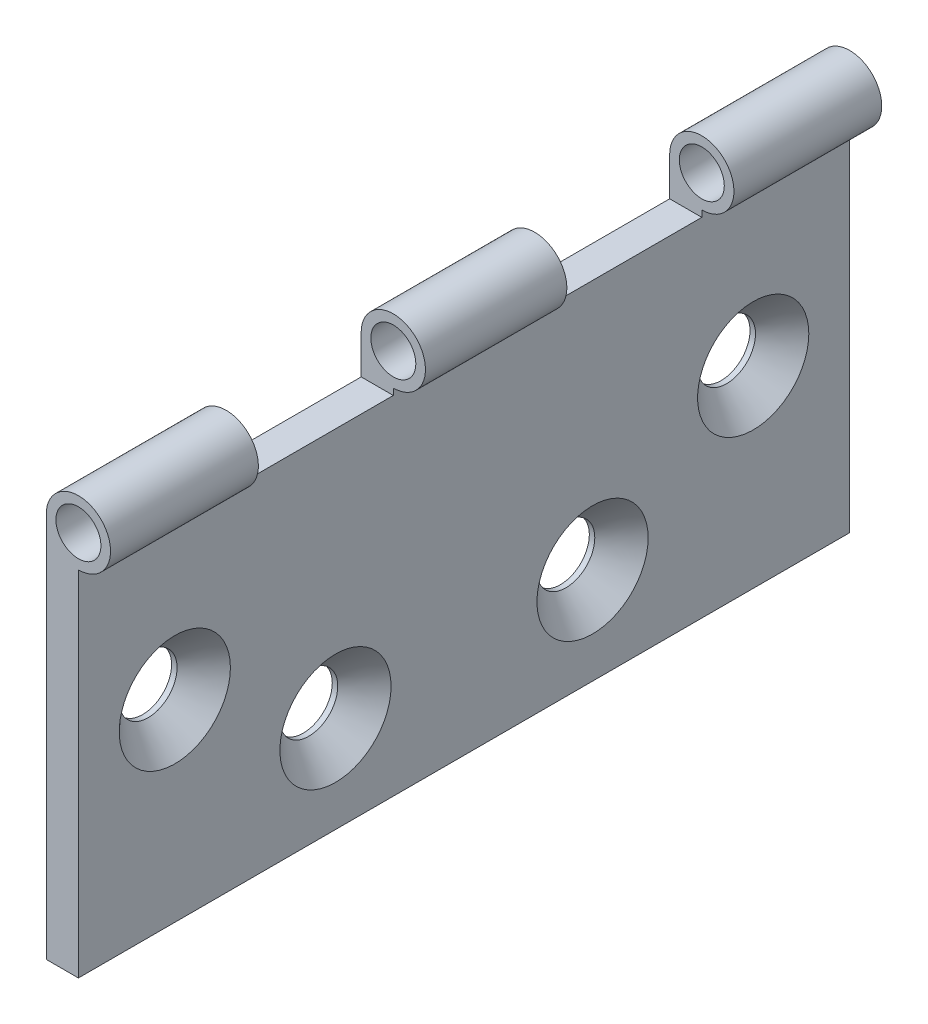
from build123d import *

# Parameters (mm, degrees)
SKETCH1_W                                      = 5
SKETCH1_H                                      = 60
EXTRUDE_THIN1_DEPTH                            = 60
SKETCH2_R                                      = 5
SKETCH3_R                                      = 3.5
CUT_EXTRUDE1_DEPTH                             = 137.839321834
CSK_FOR_M8_FLAT_HEAD_MACHINE_SCREW2_AT_2_COUNT = 2
CSK_FOR_M8_FLAT_HEAD_MACHINE_SCREW2_AT_2_PITCH = 29.154759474
F_2CUTS_DEPTH                                  = 89.600225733
F_2CUTS_DEPTH_BACK                             = 89.600225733
SKETCH12_W                                     = 26
SKETCH12_H                                     = 11


with BuildPart() as part:
    # Sketch1 → Extrude-Thin1 (new, symmetric)
    with BuildSketch(Plane.XY):
        with Locations((2.5, 30)):
            Rectangle(SKETCH1_W, SKETCH1_H)
    extrude(amount=EXTRUDE_THIN1_DEPTH, both=True)

    # Sweep1: sweep along a curve in space
    with BuildLine() as sweep1_path:
        Line((5, 60, 60), (5, 60, -60))
    # Sketch2 → Sweep1 (sweep)
    with BuildSketch(Plane.XY.offset(60)):
        with Locations((5, 60)):
            Circle(SKETCH2_R)
    sweep(path=sweep1_path.line)

    # Sketch3 → Cut-Extrude1 (cut, through all)
    with BuildSketch(Plane.XY.offset(60)):
        with Locations((5, 60)):
            Circle(SKETCH3_R)
    extrude(amount=-CUT_EXTRUDE1_DEPTH, mode=Mode.SUBTRACT)

    # Sketch6 → CSK for M8 Flat Head Machine Screw2 (revolve, cut)
    with BuildSketch(Plane(origin=(5, 30, 45), x_dir=(0, 0, -1), z_dir=(0, 1, 0))):
        Polygon((0, 0), (0, 5), (4.5, 5), (4.5, 4.15), (8.65, 0), align=None)
    csk_for_m8_flat_head_machine_screw2 = revolve(axis=Axis((11.35, 30, 45), (-1, 0, 0)), mode=Mode.SUBTRACT)

    # CSK for M8 Flat Head Machine Screw2 at 2: CSK for M8 Flat Head Machine Screw2 ×2
    with Locations(*[Vector(0, -0.5144957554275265, -0.8574929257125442) * (i * CSK_FOR_M8_FLAT_HEAD_MACHINE_SCREW2_AT_2_PITCH) for i in range(1, CSK_FOR_M8_FLAT_HEAD_MACHINE_SCREW2_AT_2_COUNT)]):
        add(csk_for_m8_flat_head_machine_screw2, mode=Mode.SUBTRACT)

    # Mirror1: CSK for M8 Flat Head Machine Screw2 across plane
    add(csk_for_m8_flat_head_machine_screw2.mirror(Plane.XY), mode=Mode.SUBTRACT)

    # Mirror1 copy 1 sketch → Mirror1 copy 1 (revolve, cut)
    with BuildSketch(Plane(origin=(5, 15, -20), x_dir=(0, 0, 1), z_dir=(0, 1, 0))):
        Polygon((0, 0), (0, -5), (4.5, -5), (4.5, -4.15), (8.65, 0), align=None)
    revolve(axis=Axis((11.35, 15, -20), (1, 0, 0)), mode=Mode.SUBTRACT)

    # Sketch12 → 2Cuts (cut, two sides: drawn at the far end of the back side and taken through both)
    with BuildSketch(Plane(origin=(5, 0, 0), x_dir=(0, 0, -1), z_dir=(1, 0, 0)).offset(-F_2CUTS_DEPTH_BACK)):
        with Locations((-24, 59.5)):
            Rectangle(SKETCH12_W, SKETCH12_H)
        with Locations((24, 59.5)):
            Rectangle(SKETCH12_W, SKETCH12_H)
    extrude(amount=F_2CUTS_DEPTH + F_2CUTS_DEPTH_BACK, mode=Mode.SUBTRACT)


solid = part.part
